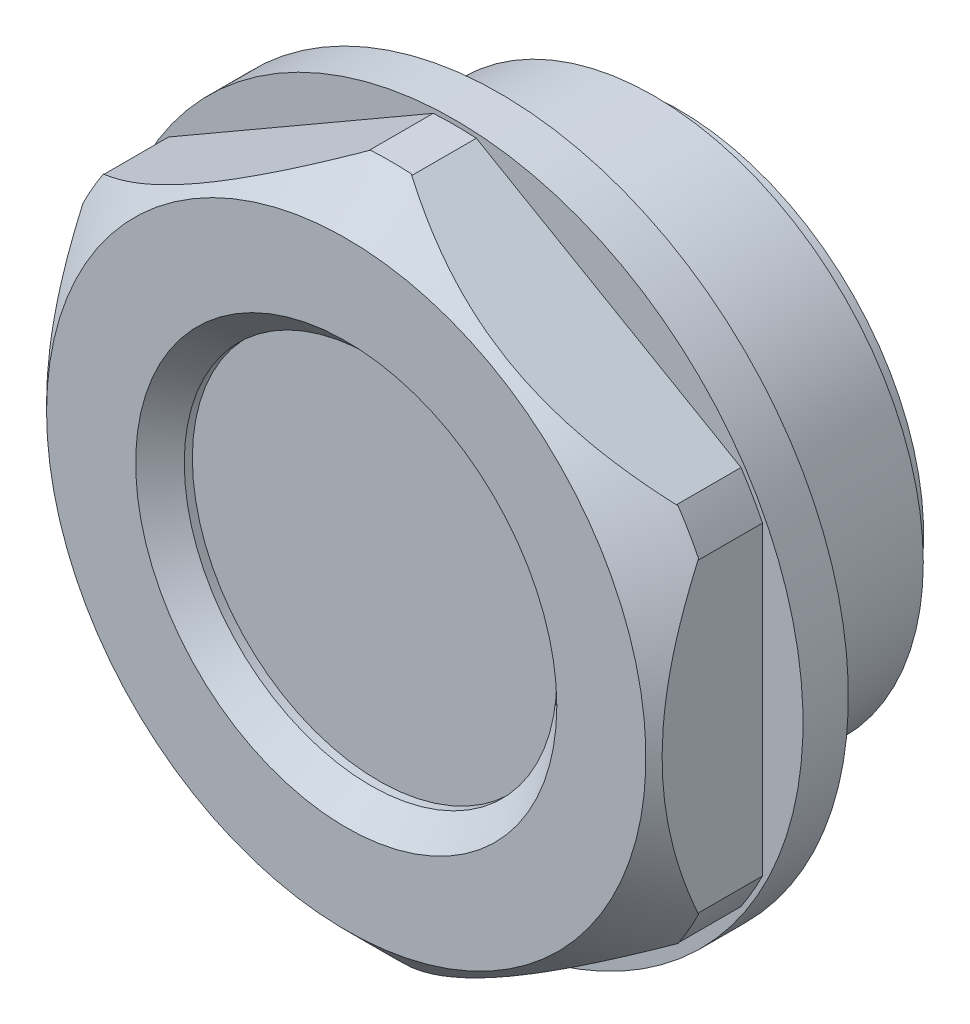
ISO-10303-21;
HEADER;
FILE_DESCRIPTION(('STEP AP214'),'2;1');
FILE_NAME('part.step','',(''),(''),'','','');
FILE_SCHEMA(('AUTOMOTIVE_DESIGN { 1 0 10303 214 1 1 1 1 }'));
ENDSEC;
DATA;
#1=APPLICATION_CONTEXT('core data for automotive mechanical design processes');
#2=APPLICATION_PROTOCOL_DEFINITION('international standard','automotive_design',2000,#1);
#3=PRODUCT_CONTEXT('',#1,'mechanical');
#4=PRODUCT('Part','Part','',(#3));
#5=PRODUCT_RELATED_PRODUCT_CATEGORY('part','',(#4));
#6=PRODUCT_DEFINITION_FORMATION('','',#4);
#7=PRODUCT_DEFINITION_CONTEXT('part definition',#1,'design');
#8=PRODUCT_DEFINITION('design','',#6,#7);
#9=PRODUCT_DEFINITION_SHAPE('','',#8);
#10=(LENGTH_UNIT() NAMED_UNIT(*) SI_UNIT(.MILLI.,.METRE.));
#11=(NAMED_UNIT(*) PLANE_ANGLE_UNIT() SI_UNIT($,.RADIAN.));
#12=(NAMED_UNIT(*) SI_UNIT($,.STERADIAN.) SOLID_ANGLE_UNIT());
#13=UNCERTAINTY_MEASURE_WITH_UNIT(LENGTH_MEASURE(1.E-05),#10,'distance_accuracy_value','');
#14=(GEOMETRIC_REPRESENTATION_CONTEXT(3) GLOBAL_UNCERTAINTY_ASSIGNED_CONTEXT((#13)) GLOBAL_UNIT_ASSIGNED_CONTEXT((#10,
#11,#12)) REPRESENTATION_CONTEXT('',''));
#15=CARTESIAN_POINT('',(0.,0.,0.));
#16=DIRECTION('',(0.,0.,1.));
#17=DIRECTION('',(1.,0.,0.));
#18=AXIS2_PLACEMENT_3D('',#15,#16,#17);
#19=CARTESIAN_POINT('',(0.,0.,0.));
#20=DIRECTION('',(0.,0.,-1.));
#21=DIRECTION('',(-1.,0.,0.));
#22=AXIS2_PLACEMENT_3D('',#19,#20,#21);
#23=CYLINDRICAL_SURFACE('',#22,21.2126992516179);
#24=CARTESIAN_POINT('',(0.,0.,4.00000000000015));
#25=DIRECTION('',(0.,0.,-1.));
#26=DIRECTION('',(-1.,0.,0.));
#27=AXIS2_PLACEMENT_3D('',#24,#25,#26);
#28=CIRCLE('',#27,21.2126992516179);
#29=CARTESIAN_POINT('',(-1.33091454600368,21.1709063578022,4.00000000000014));
#30=VERTEX_POINT('',#29);
#31=CARTESIAN_POINT('',(1.33091454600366,21.1709063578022,4.00000000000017));
#32=VERTEX_POINT('',#31);
#33=EDGE_CURVE('E157',#30,#32,#28,.T.);
#34=ORIENTED_EDGE('',*,*,#33,.F.);
#35=DIRECTION('',(0.,0.,-1.));
#36=VECTOR('',#35,1.);
#37=CARTESIAN_POINT('',(-1.33091454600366,21.1709063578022,0.));
#38=LINE('',#37,#36);
#39=CARTESIAN_POINT('',(-1.33091454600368,21.1709063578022,7.95000000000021));
#40=VERTEX_POINT('',#39);
#41=EDGE_CURVE('E339',#30,#40,#38,.F.);
#42=ORIENTED_EDGE('',*,*,#41,.T.);
#43=CARTESIAN_POINT('',(0.,0.,7.95000000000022));
#44=DIRECTION('',(0.,0.,-1.));
#45=DIRECTION('',(-1.,0.,0.));
#46=AXIS2_PLACEMENT_3D('',#43,#44,#45);
#47=CIRCLE('',#46,21.212699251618);
#48=CARTESIAN_POINT('',(1.33091454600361,21.1709063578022,7.95000000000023));
#49=VERTEX_POINT('',#48);
#50=EDGE_CURVE('E159',#40,#49,#47,.T.);
#51=ORIENTED_EDGE('',*,*,#50,.T.);
#52=DIRECTION('',(0.,0.,-1.));
#53=VECTOR('',#52,1.);
#54=CARTESIAN_POINT('',(1.33091454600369,21.1709063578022,0.));
#55=LINE('',#54,#53);
#56=EDGE_CURVE('E142',#49,#32,#55,.T.);
#57=ORIENTED_EDGE('',*,*,#56,.T.);
#58=EDGE_LOOP('',(#34,#42,#51,#57));
#59=FACE_BOUND('',#58,.T.);
#60=ADVANCED_FACE('F14',(#59),#23,.T.);
#61=CARTESIAN_POINT('',(-19.,9.43284737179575,7.9500000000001));
#62=VERTEX_POINT('',#61);
#63=CARTESIAN_POINT('',(-17.6690854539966,11.7380589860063,7.95000000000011));
#64=VERTEX_POINT('',#63);
#65=EDGE_CURVE('E174',#62,#64,#47,.T.);
#66=ORIENTED_EDGE('',*,*,#65,.T.);
#67=DIRECTION('',(0.,0.,-1.));
#68=VECTOR('',#67,1.);
#69=CARTESIAN_POINT('',(-17.6690854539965,11.7380589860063,-1.16396116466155E-13));
#70=LINE('',#69,#68);
#71=CARTESIAN_POINT('',(-17.6690854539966,11.7380589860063,4.));
#72=VERTEX_POINT('',#71);
#73=EDGE_CURVE('E337',#64,#72,#70,.T.);
#74=ORIENTED_EDGE('',*,*,#73,.T.);
#75=CARTESIAN_POINT('',(-19.,9.43284737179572,4.));
#76=VERTEX_POINT('',#75);
#77=EDGE_CURVE('E166',#76,#72,#28,.T.);
#78=ORIENTED_EDGE('',*,*,#77,.F.);
#79=DIRECTION('',(0.,0.,-1.));
#80=VECTOR('',#79,1.);
#81=CARTESIAN_POINT('',(-19.,9.43284737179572,-1.25163592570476E-13));
#82=LINE('',#81,#80);
#83=EDGE_CURVE('E331',#76,#62,#82,.F.);
#84=ORIENTED_EDGE('',*,*,#83,.T.);
#85=EDGE_LOOP('',(#66,#74,#78,#84));
#86=FACE_BOUND('',#85,.T.);
#87=ADVANCED_FACE('F239',(#86),#23,.T.);
#88=CARTESIAN_POINT('',(-17.6690854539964,-11.7380589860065,7.95000000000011));
#89=VERTEX_POINT('',#88);
#90=CARTESIAN_POINT('',(-19.,-9.43284737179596,7.9500000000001));
#91=VERTEX_POINT('',#90);
#92=EDGE_CURVE('E277',#89,#91,#47,.T.);
#93=ORIENTED_EDGE('',*,*,#92,.T.);
#94=DIRECTION('',(0.,0.,-1.));
#95=VECTOR('',#94,1.);
#96=CARTESIAN_POINT('',(-19.,-9.43284737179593,-1.25163592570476E-13));
#97=LINE('',#96,#95);
#98=CARTESIAN_POINT('',(-19.,-9.43284737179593,4.));
#99=VERTEX_POINT('',#98);
#100=EDGE_CURVE('E329',#91,#99,#97,.T.);
#101=ORIENTED_EDGE('',*,*,#100,.T.);
#102=CARTESIAN_POINT('',(-17.6690854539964,-11.7380589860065,4.));
#103=VERTEX_POINT('',#102);
#104=EDGE_CURVE('E170',#103,#99,#28,.T.);
#105=ORIENTED_EDGE('',*,*,#104,.F.);
#106=DIRECTION('',(0.,0.,-1.));
#107=VECTOR('',#106,1.);
#108=CARTESIAN_POINT('',(-17.6690854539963,-11.7380589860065,-1.16396116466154E-13));
#109=LINE('',#108,#107);
#110=EDGE_CURVE('E324',#103,#89,#109,.F.);
#111=ORIENTED_EDGE('',*,*,#110,.T.);
#112=EDGE_LOOP('',(#93,#101,#105,#111));
#113=FACE_BOUND('',#112,.T.);
#114=ADVANCED_FACE('F246',(#113),#23,.T.);
#115=CARTESIAN_POINT('',(1.33091454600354,-21.1709063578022,7.95000000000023));
#116=VERTEX_POINT('',#115);
#117=CARTESIAN_POINT('',(-1.33091454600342,-21.1709063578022,7.95000000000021));
#118=VERTEX_POINT('',#117);
#119=EDGE_CURVE('E272',#116,#118,#47,.T.);
#120=ORIENTED_EDGE('',*,*,#119,.T.);
#121=DIRECTION('',(0.,0.,-1.));
#122=VECTOR('',#121,1.);
#123=CARTESIAN_POINT('',(-1.33091454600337,-21.1709063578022,0.));
#124=LINE('',#123,#122);
#125=CARTESIAN_POINT('',(-1.33091454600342,-21.1709063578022,4.00000000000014));
#126=VERTEX_POINT('',#125);
#127=EDGE_CURVE('E322',#118,#126,#124,.T.);
#128=ORIENTED_EDGE('',*,*,#127,.T.);
#129=CARTESIAN_POINT('',(1.3309145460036,-21.1709063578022,4.00000000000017));
#130=VERTEX_POINT('',#129);
#131=EDGE_CURVE('E296',#130,#126,#28,.T.);
#132=ORIENTED_EDGE('',*,*,#131,.F.);
#133=DIRECTION('',(0.,0.,-1.));
#134=VECTOR('',#133,1.);
#135=CARTESIAN_POINT('',(1.33091454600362,-21.1709063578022,0.));
#136=LINE('',#135,#134);
#137=EDGE_CURVE('E311',#130,#116,#136,.F.);
#138=ORIENTED_EDGE('',*,*,#137,.T.);
#139=EDGE_LOOP('',(#120,#128,#132,#138));
#140=FACE_BOUND('',#139,.T.);
#141=ADVANCED_FACE('F260',(#140),#23,.T.);
#142=CARTESIAN_POINT('',(19.,-9.43284737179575,7.95000000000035));
#143=VERTEX_POINT('',#142);
#144=CARTESIAN_POINT('',(17.6690854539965,-11.7380589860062,7.95000000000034));
#145=VERTEX_POINT('',#144);
#146=EDGE_CURVE('E270',#143,#145,#47,.T.);
#147=ORIENTED_EDGE('',*,*,#146,.T.);
#148=DIRECTION('',(0.,0.,-1.));
#149=VECTOR('',#148,1.);
#150=CARTESIAN_POINT('',(17.6690854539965,-11.7380589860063,1.16396116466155E-13));
#151=LINE('',#150,#149);
#152=CARTESIAN_POINT('',(17.6690854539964,-11.7380589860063,4.00000000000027));
#153=VERTEX_POINT('',#152);
#154=EDGE_CURVE('E308',#145,#153,#151,.T.);
#155=ORIENTED_EDGE('',*,*,#154,.T.);
#156=CARTESIAN_POINT('',(19.,-9.43284737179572,4.00000000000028));
#157=VERTEX_POINT('',#156);
#158=EDGE_CURVE('E171',#157,#153,#28,.T.);
#159=ORIENTED_EDGE('',*,*,#158,.F.);
#160=DIRECTION('',(0.,0.,-1.));
#161=VECTOR('',#160,1.);
#162=CARTESIAN_POINT('',(19.,-9.43284737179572,1.25163592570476E-13));
#163=LINE('',#162,#161);
#164=EDGE_CURVE('E307',#157,#143,#163,.F.);
#165=ORIENTED_EDGE('',*,*,#164,.T.);
#166=EDGE_LOOP('',(#147,#155,#159,#165));
#167=FACE_BOUND('',#166,.T.);
#168=ADVANCED_FACE('F250',(#167),#23,.T.);
#169=CARTESIAN_POINT('',(17.6690854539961,11.7380589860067,7.95000000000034));
#170=VERTEX_POINT('',#169);
#171=CARTESIAN_POINT('',(19.,9.43284737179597,7.95000000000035));
#172=VERTEX_POINT('',#171);
#173=EDGE_CURVE('E265',#170,#172,#47,.T.);
#174=ORIENTED_EDGE('',*,*,#173,.T.);
#175=DIRECTION('',(0.,0.,-1.));
#176=VECTOR('',#175,1.);
#177=CARTESIAN_POINT('',(19.,9.43284737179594,1.25163592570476E-13));
#178=LINE('',#177,#176);
#179=CARTESIAN_POINT('',(19.,9.43284737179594,4.00000000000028));
#180=VERTEX_POINT('',#179);
#181=EDGE_CURVE('E266',#172,#180,#178,.T.);
#182=ORIENTED_EDGE('',*,*,#181,.T.);
#183=CARTESIAN_POINT('',(17.6690854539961,11.7380589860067,4.00000000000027));
#184=VERTEX_POINT('',#183);
#185=EDGE_CURVE('E167',#184,#180,#28,.T.);
#186=ORIENTED_EDGE('',*,*,#185,.F.);
#187=DIRECTION('',(0.,0.,-1.));
#188=VECTOR('',#187,1.);
#189=CARTESIAN_POINT('',(17.6690854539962,11.7380589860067,1.16396116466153E-13));
#190=LINE('',#189,#188);
#191=EDGE_CURVE('E145',#184,#170,#190,.F.);
#192=ORIENTED_EDGE('',*,*,#191,.T.);
#193=EDGE_LOOP('',(#174,#182,#186,#192));
#194=FACE_BOUND('',#193,.T.);
#195=ADVANCED_FACE('F241',(#194),#23,.T.);
#196=CARTESIAN_POINT('',(0.,-21.25,7.95000000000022));
#197=DIRECTION('',(0.,0.,-1.));
#198=DIRECTION('',(-1.,0.,0.));
#199=AXIS2_PLACEMENT_3D('',#196,#197,#198);
#200=PLANE('',#199);
#201=CARTESIAN_POINT('',(0.,0.,7.95000000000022));
#202=DIRECTION('',(0.,0.,-1.));
#203=DIRECTION('',(-1.,0.,0.));
#204=AXIS2_PLACEMENT_3D('',#201,#202,#203);
#205=CIRCLE('',#204,21.25);
#206=CARTESIAN_POINT('',(-19.,9.516433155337,7.9500000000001));
#207=VERTEX_POINT('',#206);
#208=CARTESIAN_POINT('',(-17.7414728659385,11.6962660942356,7.95000000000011));
#209=VERTEX_POINT('',#208);
#210=EDGE_CURVE('E283',#207,#209,#205,.T.);
#211=ORIENTED_EDGE('',*,*,#210,.T.);
#212=DIRECTION('',(0.866025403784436,0.5,0.));
#213=VECTOR('',#212,1.);
#214=CARTESIAN_POINT('',(-18.7015199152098,11.1419826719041,7.9500000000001));
#215=LINE('',#214,#213);
#216=EDGE_CURVE('E336',#209,#64,#215,.T.);
#217=ORIENTED_EDGE('',*,*,#216,.T.);
#218=ORIENTED_EDGE('',*,*,#65,.F.);
#219=DIRECTION('',(0.,1.,0.));
#220=VECTOR('',#219,1.);
#221=CARTESIAN_POINT('',(-19.,-21.25,7.9500000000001));
#222=LINE('',#221,#220);
#223=EDGE_CURVE('E326',#62,#207,#222,.T.);
#224=ORIENTED_EDGE('',*,*,#223,.T.);
#225=EDGE_LOOP('',(#211,#217,#218,#224));
#226=FACE_BOUND('',#225,.T.);
#227=ADVANCED_FACE('F249',(#226),#200,.T.);
#228=ORIENTED_EDGE('',*,*,#50,.F.);
#229=CARTESIAN_POINT('',(-1.25852713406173,21.2126992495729,7.95000000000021));
#230=VERTEX_POINT('',#229);
#231=EDGE_CURVE('E333',#40,#230,#215,.T.);
#232=ORIENTED_EDGE('',*,*,#231,.T.);
#233=CARTESIAN_POINT('',(1.25852713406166,21.2126992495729,7.95000000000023));
#234=VERTEX_POINT('',#233);
#235=EDGE_CURVE('E289',#230,#234,#205,.T.);
#236=ORIENTED_EDGE('',*,*,#235,.T.);
#237=DIRECTION('',(0.866025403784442,-0.5,0.));
#238=VECTOR('',#237,1.);
#239=CARTESIAN_POINT('',(18.7015199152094,11.1419826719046,7.95000000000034));
#240=LINE('',#239,#238);
#241=EDGE_CURVE('E160',#234,#49,#240,.T.);
#242=ORIENTED_EDGE('',*,*,#241,.T.);
#243=EDGE_LOOP('',(#228,#232,#236,#242));
#244=FACE_BOUND('',#243,.T.);
#245=ADVANCED_FACE('F257',(#244),#200,.T.);
#246=CARTESIAN_POINT('',(-17.7414728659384,-11.6962660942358,7.95000000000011));
#247=VERTEX_POINT('',#246);
#248=CARTESIAN_POINT('',(-19.,-9.51643315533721,7.9500000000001));
#249=VERTEX_POINT('',#248);
#250=EDGE_CURVE('E290',#247,#249,#205,.T.);
#251=ORIENTED_EDGE('',*,*,#250,.T.);
#252=EDGE_CURVE('E30',#249,#91,#222,.T.);
#253=ORIENTED_EDGE('',*,*,#252,.T.);
#254=ORIENTED_EDGE('',*,*,#92,.F.);
#255=DIRECTION('',(-0.866025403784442,0.5,0.));
#256=VECTOR('',#255,1.);
#257=CARTESIAN_POINT('',(-0.298480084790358,-21.7669826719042,7.95000000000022));
#258=LINE('',#257,#256);
#259=EDGE_CURVE('E314',#89,#247,#258,.T.);
#260=ORIENTED_EDGE('',*,*,#259,.T.);
#261=EDGE_LOOP('',(#251,#253,#254,#260));
#262=FACE_BOUND('',#261,.T.);
#263=ADVANCED_FACE('F413',(#262),#200,.T.);
#264=CARTESIAN_POINT('',(1.2585271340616,-21.2126992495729,7.95000000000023));
#265=VERTEX_POINT('',#264);
#266=CARTESIAN_POINT('',(-1.25852713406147,-21.2126992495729,7.95000000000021));
#267=VERTEX_POINT('',#266);
#268=EDGE_CURVE('E346',#265,#267,#205,.T.);
#269=ORIENTED_EDGE('',*,*,#268,.T.);
#270=EDGE_CURVE('E38',#267,#118,#258,.T.);
#271=ORIENTED_EDGE('',*,*,#270,.T.);
#272=ORIENTED_EDGE('',*,*,#119,.F.);
#273=DIRECTION('',(-0.866025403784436,-0.5,0.));
#274=VECTOR('',#273,1.);
#275=CARTESIAN_POINT('',(0.29848008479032,-21.7669826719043,7.95000000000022));
#276=LINE('',#275,#274);
#277=EDGE_CURVE('E316',#116,#265,#276,.T.);
#278=ORIENTED_EDGE('',*,*,#277,.T.);
#279=EDGE_LOOP('',(#269,#271,#272,#278));
#280=FACE_BOUND('',#279,.T.);
#281=ADVANCED_FACE('F378',(#280),#200,.T.);
#282=CARTESIAN_POINT('',(19.,-9.516433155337,7.95000000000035));
#283=VERTEX_POINT('',#282);
#284=CARTESIAN_POINT('',(17.7414728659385,-11.6962660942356,7.95000000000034));
#285=VERTEX_POINT('',#284);
#286=EDGE_CURVE('E350',#283,#285,#205,.T.);
#287=ORIENTED_EDGE('',*,*,#286,.T.);
#288=EDGE_CURVE('E312',#285,#145,#276,.T.);
#289=ORIENTED_EDGE('',*,*,#288,.T.);
#290=ORIENTED_EDGE('',*,*,#146,.F.);
#291=DIRECTION('',(0.,-1.,0.));
#292=VECTOR('',#291,1.);
#293=CARTESIAN_POINT('',(19.,-21.25,7.95000000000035));
#294=LINE('',#293,#292);
#295=EDGE_CURVE('E375',#143,#283,#294,.T.);
#296=ORIENTED_EDGE('',*,*,#295,.T.);
#297=EDGE_LOOP('',(#287,#289,#290,#296));
#298=FACE_BOUND('',#297,.T.);
#299=ADVANCED_FACE('F446',(#298),#200,.T.);
#300=CARTESIAN_POINT('',(17.7414728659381,11.6962660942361,7.95000000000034));
#301=VERTEX_POINT('',#300);
#302=CARTESIAN_POINT('',(19.,9.51643315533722,7.95000000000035));
#303=VERTEX_POINT('',#302);
#304=EDGE_CURVE('E355',#301,#303,#205,.T.);
#305=ORIENTED_EDGE('',*,*,#304,.T.);
#306=EDGE_CURVE('E377',#303,#172,#294,.T.);
#307=ORIENTED_EDGE('',*,*,#306,.T.);
#308=ORIENTED_EDGE('',*,*,#173,.F.);
#309=EDGE_CURVE('E367',#170,#301,#240,.T.);
#310=ORIENTED_EDGE('',*,*,#309,.T.);
#311=EDGE_LOOP('',(#305,#307,#308,#310));
#312=FACE_BOUND('',#311,.T.);
#313=ADVANCED_FACE('F259',(#312),#200,.T.);
#314=CARTESIAN_POINT('',(0.,0.,7.95000000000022));
#315=DIRECTION('',(0.,0.,-1.));
#316=DIRECTION('',(-1.,0.,0.));
#317=AXIS2_PLACEMENT_3D('',#314,#315,#316);
#318=CONICAL_SURFACE('',#317,21.25,0.785398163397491);
#319=CARTESIAN_POINT('',(0.,0.,10.7000000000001));
#320=DIRECTION('',(0.,0.,-1.));
#321=DIRECTION('',(-1.,0.,0.));
#322=AXIS2_PLACEMENT_3D('',#319,#320,#321);
#323=CIRCLE('',#322,18.5);
#324=CARTESIAN_POINT('',(-18.5000000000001,0.,10.7));
#325=VERTEX_POINT('',#324);
#326=EDGE_CURVE('E341',#325,#325,#323,.T.);
#327=ORIENTED_EDGE('',*,*,#326,.T.);
#328=EDGE_LOOP('',(#327));
#329=FACE_BOUND('',#328,.T.);
#330=ORIENTED_EDGE('',*,*,#235,.F.);
#331=CARTESIAN_POINT('',(-1.2581403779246,21.2129225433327,7.94980000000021));
#332=CARTESIAN_POINT('',(-1.84397380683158,20.874691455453,8.25274037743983));
#333=CARTESIAN_POINT('',(-2.43907747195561,20.5311081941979,8.53471065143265));
#334=CARTESIAN_POINT('',(-3.64878500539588,19.8326832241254,9.04497917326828));
#335=CARTESIAN_POINT('',(-4.2634555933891,19.4778029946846,9.27306486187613));
#336=CARTESIAN_POINT('',(-5.19372326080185,18.9407127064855,9.56308770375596));
#337=CARTESIAN_POINT('',(-5.50331475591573,18.7619699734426,9.6507060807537));
#338=CARTESIAN_POINT('',(-6.12595588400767,18.4024879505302,9.80783954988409));
#339=CARTESIAN_POINT('',(-6.43900559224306,18.2217486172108,9.87735424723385));
#340=CARTESIAN_POINT('',(-7.06741606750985,17.8589356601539,9.99682060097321));
#341=CARTESIAN_POINT('',(-7.38277257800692,17.6768644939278,10.0468019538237));
#342=CARTESIAN_POINT('',(-8.01542240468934,17.3116039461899,10.1262790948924));
#343=CARTESIAN_POINT('',(-8.33271566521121,17.1284145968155,10.155775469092));
#344=CARTESIAN_POINT('',(-8.94574438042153,16.7744823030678,10.192274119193));
#345=CARTESIAN_POINT('',(-9.24141564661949,16.6037764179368,10.200721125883));
#346=CARTESIAN_POINT('',(-9.83270625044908,16.2623946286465,10.199182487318));
#347=CARTESIAN_POINT('',(-10.1283255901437,16.0917187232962,10.1891979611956));
#348=CARTESIAN_POINT('',(-10.7188069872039,15.750804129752,10.1509912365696));
#349=CARTESIAN_POINT('',(-11.0136686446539,15.5805656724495,10.1227608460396));
#350=CARTESIAN_POINT('',(-11.6017516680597,15.2410357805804,10.0486065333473));
#351=CARTESIAN_POINT('',(-11.8949727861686,15.0717444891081,10.0026800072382));
#352=CARTESIAN_POINT('',(-12.4789545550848,14.7345824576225,9.89400247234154));
#353=CARTESIAN_POINT('',(-12.7697160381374,14.5667112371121,9.83125741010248));
#354=CARTESIAN_POINT('',(-13.348366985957,14.2326269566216,9.69000622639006));
#355=CARTESIAN_POINT('',(-13.6362559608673,14.0664141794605,9.61149746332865));
#356=CARTESIAN_POINT('',(-14.4950929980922,13.5705643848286,9.3540791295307));
#357=CARTESIAN_POINT('',(-15.0612287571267,13.243705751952,9.15327411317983));
#358=CARTESIAN_POINT('',(-15.7999972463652,12.8171775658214,8.85591445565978));
#359=CARTESIAN_POINT('',(-15.9794333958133,12.7135800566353,8.78087175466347));
#360=CARTESIAN_POINT('',(-16.3367380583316,12.5072901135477,8.6261138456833));
#361=CARTESIAN_POINT('',(-16.5146070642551,12.4045973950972,8.54640017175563));
#362=CARTESIAN_POINT('',(-16.8682151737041,12.2004416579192,8.38287802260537));
#363=CARTESIAN_POINT('',(-17.0439594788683,12.0989756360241,8.299084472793));
#364=CARTESIAN_POINT('',(-17.3940004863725,11.8968793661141,8.12742217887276));
#365=CARTESIAN_POINT('',(-17.5682968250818,11.7962493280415,8.03955244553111));
#366=CARTESIAN_POINT('',(-17.7418596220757,11.6960428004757,7.94980000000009));
#367=B_SPLINE_CURVE_WITH_KNOTS('',3,(#331,#332,#333,#334,#335,#336,#337,#338,#339,#340,#341,
#342,#343,#344,#345,#346,#347,#348,#349,#350,#351,#352,#353,#354,#355,#356,#357,#358,#359,#360,
#361,#362,#363,#364,#365,#366),.UNSPECIFIED.,.F.,.F.,(4,2,2,2,2,2,2,2,2,2,2,2,2,2,2,2,2,4),(0.,
2.22515927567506,4.458954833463,5.56273360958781,6.66653645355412,7.7686546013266,
8.87074122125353,9.89479990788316,10.9187964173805,11.9432530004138,12.9678603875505,
13.992105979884,15.0165233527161,17.0652965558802,17.7263822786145,18.3872520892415,
19.0458633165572,19.7046352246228),.UNSPECIFIED.);
#368=EDGE_CURVE('E9',#230,#209,#367,.T.);
#369=ORIENTED_EDGE('',*,*,#368,.T.);
#370=ORIENTED_EDGE('',*,*,#210,.F.);
#371=CARTESIAN_POINT('',(-19.,-22.4154810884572,-0.184584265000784));
#372=CARTESIAN_POINT('',(-18.9999999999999,-22.1437771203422,0.0226764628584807));
#373=CARTESIAN_POINT('',(-18.9999999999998,-21.8713174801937,0.22894578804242));
#374=CARTESIAN_POINT('',(-18.9999999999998,-21.32476107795,0.639313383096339));
#375=CARTESIAN_POINT('',(-18.9999999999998,-21.0506642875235,0.84341161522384));
#376=CARTESIAN_POINT('',(-18.9999999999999,-20.2256190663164,1.45224851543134));
#377=CARTESIAN_POINT('',(-18.9999999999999,-19.6720388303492,1.85343526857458));
#378=CARTESIAN_POINT('',(-18.9999999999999,-18.5524636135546,2.647468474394));
#379=CARTESIAN_POINT('',(-18.9999999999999,-17.9864057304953,3.04022643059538));
#380=CARTESIAN_POINT('',(-18.9999999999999,-16.8447800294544,3.81162615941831));
#381=CARTESIAN_POINT('',(-18.9999999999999,-16.2692128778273,4.19026891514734));
#382=CARTESIAN_POINT('',(-18.9999999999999,-15.0718766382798,4.95261849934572));
#383=CARTESIAN_POINT('',(-18.9999999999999,-14.4494179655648,5.33524766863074));
#384=CARTESIAN_POINT('',(-18.9999999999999,-13.1899181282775,6.07610583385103));
#385=CARTESIAN_POINT('',(-18.9999999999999,-12.5528745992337,6.43433083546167));
#386=CARTESIAN_POINT('',(-18.9999999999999,-11.2641428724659,7.11870361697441));
#387=CARTESIAN_POINT('',(-18.9999999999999,-10.6125051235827,7.44494566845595));
#388=CARTESIAN_POINT('',(-19.,-9.29109597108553,8.05804585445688));
#389=CARTESIAN_POINT('',(-19.,-8.62133313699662,8.34492222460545));
#390=CARTESIAN_POINT('',(-19.,-7.32388912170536,8.84528676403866));
#391=CARTESIAN_POINT('',(-19.,-6.69787614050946,9.06306454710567));
#392=CARTESIAN_POINT('',(-19.,-5.43018898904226,9.44846639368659));
#393=CARTESIAN_POINT('',(-19.,-4.78851378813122,9.61608714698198));
#394=CARTESIAN_POINT('',(-19.,-3.82262501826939,9.82177312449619));
#395=CARTESIAN_POINT('',(-19.,-3.50311498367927,9.88234917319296));
#396=CARTESIAN_POINT('',(-19.,-2.86160261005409,9.98831615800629));
#397=CARTESIAN_POINT('',(-19.,-2.53960062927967,10.0337092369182));
#398=CARTESIAN_POINT('',(-19.,-1.89376857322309,10.1085495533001));
#399=CARTESIAN_POINT('',(-19.,-1.56993863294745,10.1379979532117));
#400=CARTESIAN_POINT('',(-19.,-0.921197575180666,10.1804348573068));
#401=CARTESIAN_POINT('',(-19.,-0.596286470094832,10.1934235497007));
#402=CARTESIAN_POINT('',(-19.,0.0407476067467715,10.2025180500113));
#403=CARTESIAN_POINT('',(-19.,0.352861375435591,10.1992794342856));
#404=CARTESIAN_POINT('',(-19.,0.976548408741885,10.1774733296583));
#405=CARTESIAN_POINT('',(-19.,1.28812167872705,10.1589059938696));
#406=CARTESIAN_POINT('',(-19.,1.91000453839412,10.106752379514));
#407=CARTESIAN_POINT('',(-19.,2.22031412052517,10.0731660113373));
#408=CARTESIAN_POINT('',(-19.,2.83905287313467,9.99150831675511));
#409=CARTESIAN_POINT('',(-19.,3.14748179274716,9.94343509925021));
#410=CARTESIAN_POINT('',(-19.,3.76729048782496,9.83255621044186));
#411=CARTESIAN_POINT('',(-19.,4.07862634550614,9.76950562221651));
#412=CARTESIAN_POINT('',(-19.,4.69830732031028,9.63005124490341));
#413=CARTESIAN_POINT('',(-19.,5.00665206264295,9.55364580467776));
#414=CARTESIAN_POINT('',(-19.,5.92651399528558,9.30590410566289));
#415=CARTESIAN_POINT('',(-19.,6.53308639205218,9.11600047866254));
#416=CARTESIAN_POINT('',(-19.,7.77561883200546,8.6793537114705));
#417=CARTESIAN_POINT('',(-19.,8.41044992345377,8.42945294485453));
#418=CARTESIAN_POINT('',(-19.0000000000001,9.66374342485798,7.89114039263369));
#419=CARTESIAN_POINT('',(-19.0000000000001,10.2821981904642,7.60271098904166));
#420=CARTESIAN_POINT('',(-19.,11.5056678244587,6.99419434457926));
#421=CARTESIAN_POINT('',(-19.0000000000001,12.1106333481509,6.67400874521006));
#422=CARTESIAN_POINT('',(-19.0000000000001,13.3066789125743,6.00903857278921));
#423=CARTESIAN_POINT('',(-19.0000000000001,13.8977611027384,5.66425784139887));
#424=CARTESIAN_POINT('',(-19.0000000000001,15.0388896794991,4.97247995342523));
#425=CARTESIAN_POINT('',(-19.0000000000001,15.5895184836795,4.62643846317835));
#426=CARTESIAN_POINT('',(-19.0000000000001,16.68131949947,3.91970527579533));
#427=CARTESIAN_POINT('',(-19.0000000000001,17.2224909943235,3.55901247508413));
#428=CARTESIAN_POINT('',(-19.0000000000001,18.2922436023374,2.82852398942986));
#429=CARTESIAN_POINT('',(-19.0000000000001,18.8208910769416,2.4588252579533));
#430=CARTESIAN_POINT('',(-19.0000000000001,19.608480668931,1.89690942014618));
#431=CARTESIAN_POINT('',(-19.0000000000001,19.8700804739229,1.70840077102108));
#432=CARTESIAN_POINT('',(-19.0000000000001,20.3916223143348,1.32911453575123));
#433=CARTESIAN_POINT('',(-19.,20.6515643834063,1.13833699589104));
#434=CARTESIAN_POINT('',(-19.,20.9107393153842,0.946522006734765));
#435=B_SPLINE_CURVE_WITH_KNOTS('',3,(#371,#372,#373,#374,#375,#376,#377,#378,#379,#380,#381,
#382,#383,#384,#385,#386,#387,#388,#389,#390,#391,#392,#393,#394,#395,#396,#397,#398,#399,#400,
#401,#402,#403,#404,#405,#406,#407,#408,#409,#410,#411,#412,#413,#414,#415,#416,#417,#418,#419,
#420,#421,#422,#423,#424,#425,#426,#427,#428,#429,#430,#431,#432,#433,#434),.UNSPECIFIED.,.F.,
.F.,(4,2,2,2,2,2,2,2,2,2,2,2,2,2,2,2,2,2,2,2,2,2,2,2,2,2,2,2,2,2,2,4),(0.,1.02518869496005,
2.05039518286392,4.10127284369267,6.16801138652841,8.2346057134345,10.4261330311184,
12.6180181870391,14.803235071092,16.9874362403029,18.9742140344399,20.9611229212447,
21.9364251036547,22.9115895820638,23.8866829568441,24.8617651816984,25.7977799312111,
26.733785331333,27.6697963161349,28.6059295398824,29.5585758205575,30.5113399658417,
32.4161763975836,34.4614027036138,36.5075674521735,38.5602804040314,40.6126734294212,
42.5634078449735,44.5142894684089,46.4494270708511,47.4167484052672,48.3840500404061),.UNSPECIFIED.);
#436=EDGE_CURVE('E23',#207,#249,#435,.F.);
#437=ORIENTED_EDGE('',*,*,#436,.T.);
#438=ORIENTED_EDGE('',*,*,#250,.F.);
#439=CARTESIAN_POINT('',(-17.7418596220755,-11.6960428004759,7.94980000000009));
#440=CARTESIAN_POINT('',(-17.1560261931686,-12.0342738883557,8.2527403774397));
#441=CARTESIAN_POINT('',(-16.5609225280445,-12.3778571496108,8.53471065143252));
#442=CARTESIAN_POINT('',(-15.3512149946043,-13.0762821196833,9.04497917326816));
#443=CARTESIAN_POINT('',(-14.736544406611,-13.4311623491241,9.27306486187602));
#444=CARTESIAN_POINT('',(-13.8062767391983,-13.9682526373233,9.56308770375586));
#445=CARTESIAN_POINT('',(-13.4966852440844,-14.1469953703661,9.6507060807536));
#446=CARTESIAN_POINT('',(-12.8740441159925,-14.5064773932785,9.807839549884));
#447=CARTESIAN_POINT('',(-12.5609944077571,-14.6872167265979,9.87735424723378));
#448=CARTESIAN_POINT('',(-11.9325839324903,-15.0500296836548,9.99682060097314));
#449=CARTESIAN_POINT('',(-11.6172274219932,-15.232100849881,10.0468019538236));
#450=CARTESIAN_POINT('',(-10.9845775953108,-15.5973613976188,10.1262790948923));
#451=CARTESIAN_POINT('',(-10.6672843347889,-15.7805507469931,10.1557754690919));
#452=CARTESIAN_POINT('',(-10.0542556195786,-16.1344830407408,10.192274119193));
#453=CARTESIAN_POINT('',(-9.75858435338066,-16.3051889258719,10.200721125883));
#454=CARTESIAN_POINT('',(-9.1672937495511,-16.6465707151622,10.1991824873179));
#455=CARTESIAN_POINT('',(-8.87167440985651,-16.8172466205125,10.1891979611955));
#456=CARTESIAN_POINT('',(-8.28119301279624,-17.1581612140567,10.1509912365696));
#457=CARTESIAN_POINT('',(-7.98633135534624,-17.3283996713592,10.1227608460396));
#458=CARTESIAN_POINT('',(-7.39824833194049,-17.6679295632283,10.0486065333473));
#459=CARTESIAN_POINT('',(-7.10502721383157,-17.8372208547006,10.0026800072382));
#460=CARTESIAN_POINT('',(-6.52104544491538,-18.1743828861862,9.89400247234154));
#461=CARTESIAN_POINT('',(-6.23028396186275,-18.3422541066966,9.83125741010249));
#462=CARTESIAN_POINT('',(-5.65163301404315,-18.6763383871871,9.69000622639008));
#463=CARTESIAN_POINT('',(-5.36374403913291,-18.8425511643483,9.61149746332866));
#464=CARTESIAN_POINT('',(-4.50490700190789,-19.3384009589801,9.35407912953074));
#465=CARTESIAN_POINT('',(-3.93877124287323,-19.6652595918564,9.15327411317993));
#466=CARTESIAN_POINT('',(-3.20000275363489,-20.0917877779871,8.85591445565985));
#467=CARTESIAN_POINT('',(-3.02056660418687,-20.1953852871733,8.78087175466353));
#468=CARTESIAN_POINT('',(-2.6632619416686,-20.401675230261,8.62611384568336));
#469=CARTESIAN_POINT('',(-2.48539293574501,-20.5043679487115,8.54640017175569));
#470=CARTESIAN_POINT('',(-2.13178482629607,-20.7085236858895,8.38287802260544));
#471=CARTESIAN_POINT('',(-1.95604052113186,-20.8099897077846,8.29908447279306));
#472=CARTESIAN_POINT('',(-1.6059995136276,-21.0120859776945,8.12742217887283));
#473=CARTESIAN_POINT('',(-1.43170317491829,-21.1127160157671,8.03955244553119));
#474=CARTESIAN_POINT('',(-1.25814037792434,-21.2129225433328,7.94980000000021));
#475=B_SPLINE_CURVE_WITH_KNOTS('',3,(#439,#440,#441,#442,#443,#444,#445,#446,#447,#448,#449,
#450,#451,#452,#453,#454,#455,#456,#457,#458,#459,#460,#461,#462,#463,#464,#465,#466,#467,#468,
#469,#470,#471,#472,#473,#474),.UNSPECIFIED.,.F.,.F.,(4,2,2,2,2,2,2,2,2,2,2,2,2,2,2,2,2,4),(0.,
2.22515927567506,4.45895483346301,5.56273360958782,6.66653645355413,7.76865460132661,
8.87074122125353,9.89479990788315,10.9187964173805,11.9432530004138,12.9678603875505,
13.992105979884,15.016523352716,17.0652965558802,17.7263822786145,18.3872520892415,
19.0458633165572,19.7046352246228),.UNSPECIFIED.);
#476=EDGE_CURVE('E381',#247,#267,#475,.T.);
#477=ORIENTED_EDGE('',*,*,#476,.T.);
#478=ORIENTED_EDGE('',*,*,#268,.F.);
#479=CARTESIAN_POINT('',(1.25814037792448,-21.2129225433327,7.94980000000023));
#480=CARTESIAN_POINT('',(1.84397380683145,-20.874691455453,8.25274037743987));
#481=CARTESIAN_POINT('',(2.43907747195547,-20.5311081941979,8.53471065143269));
#482=CARTESIAN_POINT('',(3.64878500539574,-19.8326832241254,9.04497917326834));
#483=CARTESIAN_POINT('',(4.26345559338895,-19.4778029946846,9.2730648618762));
#484=CARTESIAN_POINT('',(5.19372326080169,-18.9407127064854,9.56308770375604));
#485=CARTESIAN_POINT('',(5.50331475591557,-18.7619699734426,9.65070608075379));
#486=CARTESIAN_POINT('',(6.12595588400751,-18.4024879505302,9.80783954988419));
#487=CARTESIAN_POINT('',(6.4390055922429,-18.2217486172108,9.87735424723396));
#488=CARTESIAN_POINT('',(7.06741606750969,-17.8589356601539,9.99682060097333));
#489=CARTESIAN_POINT('',(7.38277257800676,-17.6768644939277,10.0468019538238));
#490=CARTESIAN_POINT('',(8.01542240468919,-17.3116039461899,10.1262790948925));
#491=CARTESIAN_POINT('',(8.33271566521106,-17.1284145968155,10.1557754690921));
#492=CARTESIAN_POINT('',(8.94574438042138,-16.7744823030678,10.1922741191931));
#493=CARTESIAN_POINT('',(9.24141564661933,-16.6037764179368,10.2007211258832));
#494=CARTESIAN_POINT('',(9.83270625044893,-16.2623946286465,10.1991824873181));
#495=CARTESIAN_POINT('',(10.1283255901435,-16.0917187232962,10.1891979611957));
#496=CARTESIAN_POINT('',(10.7188069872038,-15.750804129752,10.1509912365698));
#497=CARTESIAN_POINT('',(11.0136686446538,-15.5805656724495,10.1227608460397));
#498=CARTESIAN_POINT('',(11.6017516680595,-15.2410357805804,10.0486065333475));
#499=CARTESIAN_POINT('',(11.8949727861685,-15.0717444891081,10.0026800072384));
#500=CARTESIAN_POINT('',(12.4789545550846,-14.7345824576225,9.89400247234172));
#501=CARTESIAN_POINT('',(12.7697160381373,-14.5667112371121,9.83125741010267));
#502=CARTESIAN_POINT('',(13.3483669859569,-14.2326269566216,9.69000622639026));
#503=CARTESIAN_POINT('',(13.6362559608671,-14.0664141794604,9.61149746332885));
#504=CARTESIAN_POINT('',(14.4950929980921,-13.5705643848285,9.3540791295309));
#505=CARTESIAN_POINT('',(15.0612287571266,-13.243705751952,9.15327411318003));
#506=CARTESIAN_POINT('',(15.7999972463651,-12.8171775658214,8.85591445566));
#507=CARTESIAN_POINT('',(15.9794333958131,-12.7135800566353,8.78087175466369));
#508=CARTESIAN_POINT('',(16.3367380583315,-12.5072901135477,8.62611384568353));
#509=CARTESIAN_POINT('',(16.514607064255,-12.4045973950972,8.54640017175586));
#510=CARTESIAN_POINT('',(16.868215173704,-12.2004416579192,8.38287802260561));
#511=CARTESIAN_POINT('',(17.0439594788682,-12.0989756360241,8.29908447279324));
#512=CARTESIAN_POINT('',(17.3940004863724,-11.8968793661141,8.127422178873));
#513=CARTESIAN_POINT('',(17.5682968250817,-11.7962493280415,8.03955244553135));
#514=CARTESIAN_POINT('',(17.7418596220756,-11.6960428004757,7.94980000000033));
#515=B_SPLINE_CURVE_WITH_KNOTS('',3,(#479,#480,#481,#482,#483,#484,#485,#486,#487,#488,#489,
#490,#491,#492,#493,#494,#495,#496,#497,#498,#499,#500,#501,#502,#503,#504,#505,#506,#507,#508,
#509,#510,#511,#512,#513,#514),.UNSPECIFIED.,.F.,.F.,(4,2,2,2,2,2,2,2,2,2,2,2,2,2,2,2,2,4),(0.,
2.22515927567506,4.458954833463,5.56273360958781,6.66653645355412,7.76865460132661,
8.87074122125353,9.89479990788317,10.9187964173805,11.9432530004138,12.9678603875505,
13.992105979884,15.0165233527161,17.0652965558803,17.7263822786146,18.3872520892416,
19.0458633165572,19.7046352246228),.UNSPECIFIED.);
#516=EDGE_CURVE('E380',#265,#285,#515,.T.);
#517=ORIENTED_EDGE('',*,*,#516,.T.);
#518=ORIENTED_EDGE('',*,*,#286,.F.);
#519=CARTESIAN_POINT('',(19.,-22.415481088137,-0.184584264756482));
#520=CARTESIAN_POINT('',(19.,-22.1437771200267,0.0226764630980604));
#521=CARTESIAN_POINT('',(19.,-21.8713174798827,0.228945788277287));
#522=CARTESIAN_POINT('',(19.0000000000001,-21.3247610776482,0.639313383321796));
#523=CARTESIAN_POINT('',(19.,-21.0506642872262,0.843411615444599));
#524=CARTESIAN_POINT('',(19.,-20.225619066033,1.45224851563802));
#525=CARTESIAN_POINT('',(19.,-19.6720388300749,1.85343526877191));
#526=CARTESIAN_POINT('',(19.,-18.5524636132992,2.64746847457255));
#527=CARTESIAN_POINT('',(19.,-17.9864057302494,3.0402264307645));
#528=CARTESIAN_POINT('',(19.,-16.8447800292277,3.81162615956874));
#529=CARTESIAN_POINT('',(19.,-16.2692128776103,4.19026891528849));
#530=CARTESIAN_POINT('',(19.,-15.0718766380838,4.95261849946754));
#531=CARTESIAN_POINT('',(19.,-14.4494179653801,5.33524766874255));
#532=CARTESIAN_POINT('',(19.,-13.1899181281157,6.07610583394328));
#533=CARTESIAN_POINT('',(19.,-12.5528745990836,6.43433083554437));
#534=CARTESIAN_POINT('',(18.9999999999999,-11.2641428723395,7.11870361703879));
#535=CARTESIAN_POINT('',(18.9999999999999,-10.6125051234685,7.44494566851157));
#536=CARTESIAN_POINT('',(19.,-9.29109597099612,8.05804585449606));
#537=CARTESIAN_POINT('',(19.,-8.62133313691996,8.34492222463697));
#538=CARTESIAN_POINT('',(19.,-7.32388912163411,8.8452867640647));
#539=CARTESIAN_POINT('',(18.9999999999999,-6.69787614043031,9.06306454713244));
#540=CARTESIAN_POINT('',(18.9999999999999,-5.43018898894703,9.44846639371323));
#541=CARTESIAN_POINT('',(18.9999999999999,-4.7885137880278,9.61608714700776));
#542=CARTESIAN_POINT('',(18.9999999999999,-3.82262501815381,9.82177312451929));
#543=CARTESIAN_POINT('',(18.9999999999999,-3.50311498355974,9.88234917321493));
#544=CARTESIAN_POINT('',(18.9999999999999,-2.86160260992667,9.98831615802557));
#545=CARTESIAN_POINT('',(18.9999999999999,-2.53960062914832,10.0337092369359));
#546=CARTESIAN_POINT('',(18.9999999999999,-1.89376857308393,10.1085495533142));
#547=CARTESIAN_POINT('',(18.9999999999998,-1.56993863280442,10.1379979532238));
#548=CARTESIAN_POINT('',(18.9999999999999,-0.921197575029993,10.1804348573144));
#549=CARTESIAN_POINT('',(19.,-0.596286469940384,10.1934235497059));
#550=CARTESIAN_POINT('',(19.,0.0407476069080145,10.2025180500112));
#551=CARTESIAN_POINT('',(18.9999999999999,0.35286137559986,10.1992794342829));
#552=CARTESIAN_POINT('',(18.9999999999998,0.97654840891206,10.1774733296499));
#553=CARTESIAN_POINT('',(18.9999999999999,1.2881216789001,10.1589059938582));
#554=CARTESIAN_POINT('',(18.9999999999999,1.91000453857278,10.1067523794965));
#555=CARTESIAN_POINT('',(18.9999999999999,2.22031412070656,10.0731660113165));
#556=CARTESIAN_POINT('',(18.9999999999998,2.83905287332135,9.99150831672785));
#557=CARTESIAN_POINT('',(18.9999999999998,3.14748179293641,9.9434350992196));
#558=CARTESIAN_POINT('',(18.9999999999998,3.76729048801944,9.83255621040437));
#559=CARTESIAN_POINT('',(18.9999999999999,4.07862634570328,9.76950562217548));
#560=CARTESIAN_POINT('',(18.9999999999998,4.69830732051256,9.63005124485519));
#561=CARTESIAN_POINT('',(18.9999999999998,5.00665206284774,9.55364580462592));
#562=CARTESIAN_POINT('',(18.9999999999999,5.92651399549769,9.30590410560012));
#563=CARTESIAN_POINT('',(19.,6.5330863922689,9.11600047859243));
#564=CARTESIAN_POINT('',(19.,7.77561883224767,8.67935371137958));
#565=CARTESIAN_POINT('',(18.9999999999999,8.41044992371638,8.42945294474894));
#566=CARTESIAN_POINT('',(18.9999999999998,9.66374342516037,7.8911403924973));
#567=CARTESIAN_POINT('',(18.9999999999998,10.2821981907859,7.60271098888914));
#568=CARTESIAN_POINT('',(18.9999999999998,11.5056678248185,6.9941943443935));
#569=CARTESIAN_POINT('',(18.9999999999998,12.1106333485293,6.67400874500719));
#570=CARTESIAN_POINT('',(18.9999999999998,13.3066789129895,6.00903857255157));
#571=CARTESIAN_POINT('',(18.9999999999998,13.8977611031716,5.66425784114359));
#572=CARTESIAN_POINT('',(18.9999999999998,15.0388896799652,4.97247995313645));
#573=CARTESIAN_POINT('',(18.9999999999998,15.5895184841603,4.62643846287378));
#574=CARTESIAN_POINT('',(18.9999999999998,16.6813194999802,3.91970527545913));
#575=CARTESIAN_POINT('',(18.9999999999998,17.2224909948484,3.55901247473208));
#576=CARTESIAN_POINT('',(18.9999999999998,18.2922436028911,2.82852398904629));
#577=CARTESIAN_POINT('',(18.9999999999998,18.8208910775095,2.45882525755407));
#578=CARTESIAN_POINT('',(18.9999999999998,19.6084806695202,1.89690941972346));
#579=CARTESIAN_POINT('',(18.9999999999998,19.8700804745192,1.70840077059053));
#580=CARTESIAN_POINT('',(18.9999999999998,20.3916223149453,1.32911453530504));
#581=CARTESIAN_POINT('',(18.9999999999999,20.6515643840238,1.13833699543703));
#582=CARTESIAN_POINT('',(19.,20.9107393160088,0.946522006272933));
#583=B_SPLINE_CURVE_WITH_KNOTS('',3,(#519,#520,#521,#522,#523,#524,#525,#526,#527,#528,#529,
#530,#531,#532,#533,#534,#535,#536,#537,#538,#539,#540,#541,#542,#543,#544,#545,#546,#547,#548,
#549,#550,#551,#552,#553,#554,#555,#556,#557,#558,#559,#560,#561,#562,#563,#564,#565,#566,#567,
#568,#569,#570,#571,#572,#573,#574,#575,#576,#577,#578,#579,#580,#581,#582),.UNSPECIFIED.,.F.,
.F.,(4,2,2,2,2,2,2,2,2,2,2,2,2,2,2,2,2,2,2,2,2,2,2,2,2,2,2,2,2,2,2,4),(0.,1.02518869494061,
2.05039518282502,4.10127284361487,6.16801138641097,8.23460571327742,10.4261330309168,
12.6180181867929,14.8032350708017,16.9874362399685,18.9742140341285,20.9611229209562,
21.9364251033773,22.9115895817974,23.8866829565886,24.861765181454,25.7977799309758,
26.7337853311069,27.6697963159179,28.6059295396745,29.5585758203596,30.5113399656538,
32.4161763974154,34.4614027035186,36.5075674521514,38.5602804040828,40.612673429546,
42.5634078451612,44.5142894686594,46.4494270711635,47.4167484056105,48.3840500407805),.UNSPECIFIED.);
#584=EDGE_CURVE('E208',#283,#303,#583,.T.);
#585=ORIENTED_EDGE('',*,*,#584,.T.);
#586=ORIENTED_EDGE('',*,*,#304,.F.);
#587=CARTESIAN_POINT('',(17.7418596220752,11.6960428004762,7.94980000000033));
#588=CARTESIAN_POINT('',(17.1560261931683,12.034273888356,8.25274037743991));
#589=CARTESIAN_POINT('',(16.5609225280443,12.3778571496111,8.5347106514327));
#590=CARTESIAN_POINT('',(15.351214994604,13.0762821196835,9.0449791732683));
#591=CARTESIAN_POINT('',(14.7365444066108,13.4311623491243,9.27306486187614));
#592=CARTESIAN_POINT('',(13.8062767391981,13.9682526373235,9.56308770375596));
#593=CARTESIAN_POINT('',(13.4966852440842,14.1469953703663,9.65070608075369));
#594=CARTESIAN_POINT('',(12.8740441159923,14.5064773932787,9.80783954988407));
#595=CARTESIAN_POINT('',(12.5609944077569,14.6872167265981,9.87735424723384));
#596=CARTESIAN_POINT('',(11.9325839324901,15.050029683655,9.99682060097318));
#597=CARTESIAN_POINT('',(11.6172274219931,15.2321008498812,10.0468019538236));
#598=CARTESIAN_POINT('',(10.9845775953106,15.597361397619,10.1262790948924));
#599=CARTESIAN_POINT('',(10.6672843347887,15.7805507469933,10.155775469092));
#600=CARTESIAN_POINT('',(10.0542556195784,16.1344830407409,10.192274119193));
#601=CARTESIAN_POINT('',(9.75858435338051,16.305188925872,10.200721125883));
#602=CARTESIAN_POINT('',(9.16729374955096,16.6465707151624,10.1991824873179));
#603=CARTESIAN_POINT('',(8.87167440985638,16.8172466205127,10.1891979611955));
#604=CARTESIAN_POINT('',(8.28119301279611,17.1581612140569,10.1509912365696));
#605=CARTESIAN_POINT('',(7.98633135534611,17.3283996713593,10.1227608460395));
#606=CARTESIAN_POINT('',(7.39824833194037,17.6679295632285,10.0486065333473));
#607=CARTESIAN_POINT('',(7.10502721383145,17.8372208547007,10.0026800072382));
#608=CARTESIAN_POINT('',(6.52104544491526,18.1743828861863,9.89400247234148));
#609=CARTESIAN_POINT('',(6.23028396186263,18.3422541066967,9.83125741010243));
#610=CARTESIAN_POINT('',(5.65163301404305,18.6763383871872,9.69000622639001));
#611=CARTESIAN_POINT('',(5.36374403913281,18.8425511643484,9.61149746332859));
#612=CARTESIAN_POINT('',(4.5049070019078,19.3384009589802,9.35407912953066));
#613=CARTESIAN_POINT('',(3.93877124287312,19.6652595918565,9.15327411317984));
#614=CARTESIAN_POINT('',(3.20000275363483,20.0917877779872,8.85591445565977));
#615=CARTESIAN_POINT('',(3.02056660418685,20.1953852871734,8.78087175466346));
#616=CARTESIAN_POINT('',(2.66326194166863,20.4016752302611,8.6261138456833));
#617=CARTESIAN_POINT('',(2.48539293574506,20.5043679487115,8.54640017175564));
#618=CARTESIAN_POINT('',(2.13178482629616,20.7085236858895,8.38287802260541));
#619=CARTESIAN_POINT('',(1.95604052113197,20.8099897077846,8.29908447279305));
#620=CARTESIAN_POINT('',(1.60599951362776,21.0120859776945,8.12742217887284));
#621=CARTESIAN_POINT('',(1.43170317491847,21.1127160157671,8.03955244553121));
#622=CARTESIAN_POINT('',(1.25814037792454,21.2129225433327,7.94980000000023));
#623=B_SPLINE_CURVE_WITH_KNOTS('',3,(#587,#588,#589,#590,#591,#592,#593,#594,#595,#596,#597,
#598,#599,#600,#601,#602,#603,#604,#605,#606,#607,#608,#609,#610,#611,#612,#613,#614,#615,#616,
#617,#618,#619,#620,#621,#622),.UNSPECIFIED.,.F.,.F.,(4,2,2,2,2,2,2,2,2,2,2,2,2,2,2,2,2,4),(0.,
2.225159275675,4.45895483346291,5.5627336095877,6.66653645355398,7.76865460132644,
8.87074122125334,9.89479990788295,10.9187964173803,11.9432530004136,12.9678603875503,
13.9921059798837,15.0165233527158,17.0652965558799,17.7263822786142,18.3872520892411,
19.0458633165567,19.7046352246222),.UNSPECIFIED.);
#624=EDGE_CURVE('E199',#301,#234,#623,.T.);
#625=ORIENTED_EDGE('',*,*,#624,.T.);
#626=EDGE_LOOP('',(#330,#369,#370,#437,#438,#477,#478,#517,#518,#585,#586,#625));
#627=FACE_BOUND('',#626,.T.);
#628=ADVANCED_FACE('F215',(#329,#627),#318,.T.);
#629=CARTESIAN_POINT('',(0.,-15.1455,-9.8));
#630=DIRECTION('',(0.,0.,-1.));
#631=DIRECTION('',(-1.,0.,0.));
#632=AXIS2_PLACEMENT_3D('',#629,#630,#631);
#633=PLANE('',#632);
#634=CARTESIAN_POINT('',(0.,0.,-9.8));
#635=DIRECTION('',(0.,0.,-1.));
#636=DIRECTION('',(-1.,0.,0.));
#637=AXIS2_PLACEMENT_3D('',#634,#635,#636);
#638=CIRCLE('',#637,15.1455);
#639=CARTESIAN_POINT('',(-15.1454999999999,0.,-9.8000000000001));
#640=VERTEX_POINT('',#639);
#641=EDGE_CURVE('E196',#640,#640,#638,.T.);
#642=ORIENTED_EDGE('',*,*,#641,.T.);
#643=EDGE_LOOP('',(#642));
#644=FACE_BOUND('',#643,.T.);
#645=ADVANCED_FACE('F16',(#644),#633,.T.);
#646=CARTESIAN_POINT('',(0.,0.,0.));
#647=DIRECTION('',(0.,0.,-1.));
#648=DIRECTION('',(-1.,0.,0.));
#649=AXIS2_PLACEMENT_3D('',#646,#647,#648);
#650=CYLINDRICAL_SURFACE('',#649,15.1455);
#651=CARTESIAN_POINT('',(0.,0.,-8.29999999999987));
#652=DIRECTION('',(0.,0.,-1.));
#653=DIRECTION('',(-1.,0.,0.));
#654=AXIS2_PLACEMENT_3D('',#651,#652,#653);
#655=CIRCLE('',#654,15.1455);
#656=CARTESIAN_POINT('',(-15.1454999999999,0.,-8.29999999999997));
#657=VERTEX_POINT('',#656);
#658=EDGE_CURVE('E193',#657,#657,#655,.T.);
#659=ORIENTED_EDGE('',*,*,#658,.T.);
#660=EDGE_LOOP('',(#659));
#661=FACE_BOUND('',#660,.T.);
#662=ORIENTED_EDGE('',*,*,#641,.F.);
#663=EDGE_LOOP('',(#662));
#664=FACE_BOUND('',#663,.T.);
#665=ADVANCED_FACE('F554',(#661,#664),#650,.T.);
#666=CARTESIAN_POINT('',(0.,-16.6245,-8.29999999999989));
#667=DIRECTION('',(0.,0.,-1.));
#668=DIRECTION('',(-1.,0.,0.));
#669=AXIS2_PLACEMENT_3D('',#666,#667,#668);
#670=PLANE('',#669);
#671=CARTESIAN_POINT('',(0.,0.,-8.29999999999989));
#672=DIRECTION('',(0.,0.,-1.));
#673=DIRECTION('',(-1.,0.,0.));
#674=AXIS2_PLACEMENT_3D('',#671,#672,#673);
#675=CIRCLE('',#674,16.6245);
#676=CARTESIAN_POINT('',(-16.6244999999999,0.,-8.3));
#677=VERTEX_POINT('',#676);
#678=EDGE_CURVE('E190',#677,#677,#675,.T.);
#679=ORIENTED_EDGE('',*,*,#678,.T.);
#680=EDGE_LOOP('',(#679));
#681=FACE_BOUND('',#680,.T.);
#682=ORIENTED_EDGE('',*,*,#658,.F.);
#683=EDGE_LOOP('',(#682));
#684=FACE_BOUND('',#683,.T.);
#685=ADVANCED_FACE('F562',(#681,#684),#670,.T.);
#686=CARTESIAN_POINT('',(0.,0.,0.));
#687=DIRECTION('',(0.,0.,-1.));
#688=DIRECTION('',(-1.,0.,0.));
#689=AXIS2_PLACEMENT_3D('',#686,#687,#688);
#690=CYLINDRICAL_SURFACE('',#689,16.6245);
#691=CARTESIAN_POINT('',(0.,0.,1.16088330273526E-13));
#692=DIRECTION('',(0.,0.,-1.));
#693=DIRECTION('',(-1.,0.,0.));
#694=AXIS2_PLACEMENT_3D('',#691,#692,#693);
#695=CIRCLE('',#694,16.6245);
#696=CARTESIAN_POINT('',(-16.6245,0.,0.));
#697=VERTEX_POINT('',#696);
#698=EDGE_CURVE('E187',#697,#697,#695,.T.);
#699=ORIENTED_EDGE('',*,*,#698,.T.);
#700=EDGE_LOOP('',(#699));
#701=FACE_BOUND('',#700,.T.);
#702=ORIENTED_EDGE('',*,*,#678,.F.);
#703=EDGE_LOOP('',(#702));
#704=FACE_BOUND('',#703,.T.);
#705=ADVANCED_FACE('F570',(#701,#704),#690,.T.);
#706=CARTESIAN_POINT('',(0.,-16.6245,1.16088330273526E-13));
#707=DIRECTION('',(0.,0.,-1.));
#708=DIRECTION('',(-1.,0.,0.));
#709=AXIS2_PLACEMENT_3D('',#706,#707,#708);
#710=PLANE('',#709);
#711=CARTESIAN_POINT('',(0.,0.,1.32676367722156E-13));
#712=DIRECTION('',(0.,0.,-1.));
#713=DIRECTION('',(-1.,0.,0.));
#714=AXIS2_PLACEMENT_3D('',#711,#712,#713);
#715=CIRCLE('',#714,19.);
#716=CARTESIAN_POINT('',(-19.,0.,0.));
#717=VERTEX_POINT('',#716);
#718=EDGE_CURVE('E184',#717,#717,#715,.T.);
#719=ORIENTED_EDGE('',*,*,#718,.T.);
#720=EDGE_LOOP('',(#719));
#721=FACE_BOUND('',#720,.T.);
#722=ORIENTED_EDGE('',*,*,#698,.F.);
#723=EDGE_LOOP('',(#722));
#724=FACE_BOUND('',#723,.T.);
#725=ADVANCED_FACE('F579',(#721,#724),#710,.T.);
#726=CARTESIAN_POINT('',(0.,0.,0.));
#727=DIRECTION('',(0.,0.,-1.));
#728=DIRECTION('',(-1.,0.,0.));
#729=AXIS2_PLACEMENT_3D('',#726,#727,#728);
#730=CYLINDRICAL_SURFACE('',#729,19.);
#731=CARTESIAN_POINT('',(0.,0.,1.20000000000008));
#732=DIRECTION('',(0.,0.,-1.));
#733=DIRECTION('',(-1.,0.,0.));
#734=AXIS2_PLACEMENT_3D('',#731,#732,#733);
#735=CIRCLE('',#734,19.);
#736=CARTESIAN_POINT('',(-19.,0.,1.19999999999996));
#737=VERTEX_POINT('',#736);
#738=EDGE_CURVE('E181',#737,#737,#735,.T.);
#739=ORIENTED_EDGE('',*,*,#738,.T.);
#740=EDGE_LOOP('',(#739));
#741=FACE_BOUND('',#740,.T.);
#742=ORIENTED_EDGE('',*,*,#718,.F.);
#743=EDGE_LOOP('',(#742));
#744=FACE_BOUND('',#743,.T.);
#745=ADVANCED_FACE('F588',(#741,#744),#730,.T.);
#746=CARTESIAN_POINT('',(0.,-21.5,1.20000000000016));
#747=DIRECTION('',(0.,0.,-1.));
#748=DIRECTION('',(-1.,0.,0.));
#749=AXIS2_PLACEMENT_3D('',#746,#747,#748);
#750=PLANE('',#749);
#751=CARTESIAN_POINT('',(0.,0.,1.20000000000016));
#752=DIRECTION('',(0.,0.,-1.));
#753=DIRECTION('',(-1.,0.,0.));
#754=AXIS2_PLACEMENT_3D('',#751,#752,#753);
#755=CIRCLE('',#754,21.5);
#756=CARTESIAN_POINT('',(-21.5,0.,1.20000000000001));
#757=VERTEX_POINT('',#756);
#758=EDGE_CURVE('E178',#757,#757,#755,.T.);
#759=ORIENTED_EDGE('',*,*,#758,.T.);
#760=EDGE_LOOP('',(#759));
#761=FACE_BOUND('',#760,.T.);
#762=ORIENTED_EDGE('',*,*,#738,.F.);
#763=EDGE_LOOP('',(#762));
#764=FACE_BOUND('',#763,.T.);
#765=ADVANCED_FACE('F597',(#761,#764),#750,.T.);
#766=CARTESIAN_POINT('',(0.,0.,0.));
#767=DIRECTION('',(0.,0.,-1.));
#768=DIRECTION('',(-1.,0.,0.));
#769=AXIS2_PLACEMENT_3D('',#766,#767,#768);
#770=CYLINDRICAL_SURFACE('',#769,21.5);
#771=CARTESIAN_POINT('',(0.,0.,4.00000000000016));
#772=DIRECTION('',(0.,0.,-1.));
#773=DIRECTION('',(-1.,0.,0.));
#774=AXIS2_PLACEMENT_3D('',#771,#772,#773);
#775=CIRCLE('',#774,21.5);
#776=CARTESIAN_POINT('',(-21.5,0.,4.00000000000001));
#777=VERTEX_POINT('',#776);
#778=EDGE_CURVE('E169',#777,#777,#775,.T.);
#779=ORIENTED_EDGE('',*,*,#778,.T.);
#780=EDGE_LOOP('',(#779));
#781=FACE_BOUND('',#780,.T.);
#782=ORIENTED_EDGE('',*,*,#758,.F.);
#783=EDGE_LOOP('',(#782));
#784=FACE_BOUND('',#783,.T.);
#785=ADVANCED_FACE('F234',(#781,#784),#770,.T.);
#786=CARTESIAN_POINT('',(0.,-21.5,4.00000000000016));
#787=DIRECTION('',(0.,0.,1.));
#788=DIRECTION('',(1.,0.,0.));
#789=AXIS2_PLACEMENT_3D('',#786,#787,#788);
#790=PLANE('',#789);
#791=DIRECTION('',(0.866025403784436,0.5,0.));
#792=VECTOR('',#791,1.);
#793=CARTESIAN_POINT('',(0.,21.9393102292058,4.00000000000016));
#794=LINE('',#793,#792);
#795=EDGE_CURVE('E151',#72,#30,#794,.T.);
#796=ORIENTED_EDGE('',*,*,#795,.T.);
#797=ORIENTED_EDGE('',*,*,#33,.T.);
#798=DIRECTION('',(0.866025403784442,-0.5,0.));
#799=VECTOR('',#798,1.);
#800=CARTESIAN_POINT('',(19.,10.9696551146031,4.00000000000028));
#801=LINE('',#800,#799);
#802=EDGE_CURVE('E139',#32,#184,#801,.T.);
#803=ORIENTED_EDGE('',*,*,#802,.T.);
#804=ORIENTED_EDGE('',*,*,#185,.T.);
#805=DIRECTION('',(0.,-1.,0.));
#806=VECTOR('',#805,1.);
#807=CARTESIAN_POINT('',(19.,-10.9696551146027,4.00000000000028));
#808=LINE('',#807,#806);
#809=EDGE_CURVE('E150',#180,#157,#808,.T.);
#810=ORIENTED_EDGE('',*,*,#809,.T.);
#811=ORIENTED_EDGE('',*,*,#158,.T.);
#812=DIRECTION('',(-0.866025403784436,-0.5,0.));
#813=VECTOR('',#812,1.);
#814=CARTESIAN_POINT('',(1.00826684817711E-13,-21.9393102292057,4.00000000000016));
#815=LINE('',#814,#813);
#816=EDGE_CURVE('E306',#153,#130,#815,.T.);
#817=ORIENTED_EDGE('',*,*,#816,.T.);
#818=ORIENTED_EDGE('',*,*,#131,.T.);
#819=DIRECTION('',(-0.866025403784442,0.5,0.));
#820=VECTOR('',#819,1.);
#821=CARTESIAN_POINT('',(-19.,-10.969655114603,4.));
#822=LINE('',#821,#820);
#823=EDGE_CURVE('E370',#126,#103,#822,.T.);
#824=ORIENTED_EDGE('',*,*,#823,.T.);
#825=ORIENTED_EDGE('',*,*,#104,.T.);
#826=DIRECTION('',(0.,1.,0.));
#827=VECTOR('',#826,1.);
#828=CARTESIAN_POINT('',(-19.,10.9696551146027,4.));
#829=LINE('',#828,#827);
#830=EDGE_CURVE('E368',#99,#76,#829,.T.);
#831=ORIENTED_EDGE('',*,*,#830,.T.);
#832=ORIENTED_EDGE('',*,*,#77,.T.);
#833=EDGE_LOOP('',(#796,#797,#803,#804,#810,#811,#817,#818,#824,#825,#831,#832));
#834=FACE_BOUND('',#833,.T.);
#835=ORIENTED_EDGE('',*,*,#778,.F.);
#836=EDGE_LOOP('',(#835));
#837=FACE_BOUND('',#836,.T.);
#838=ADVANCED_FACE('F163',(#834,#837),#790,.T.);
#839=CARTESIAN_POINT('',(0.,-18.5,10.7000000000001));
#840=DIRECTION('',(0.,0.,1.));
#841=DIRECTION('',(1.,0.,0.));
#842=AXIS2_PLACEMENT_3D('',#839,#840,#841);
#843=PLANE('',#842);
#844=CARTESIAN_POINT('',(0.,0.,10.7000000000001));
#845=DIRECTION('',(0.,0.,1.));
#846=DIRECTION('',(1.,0.,0.));
#847=AXIS2_PLACEMENT_3D('',#844,#845,#846);
#848=CIRCLE('',#847,13.);
#849=CARTESIAN_POINT('',(13.0000000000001,0.,10.7000000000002));
#850=VERTEX_POINT('',#849);
#851=EDGE_CURVE('E18',#850,#850,#848,.T.);
#852=ORIENTED_EDGE('',*,*,#851,.F.);
#853=EDGE_LOOP('',(#852));
#854=FACE_BOUND('',#853,.T.);
#855=ORIENTED_EDGE('',*,*,#326,.F.);
#856=EDGE_LOOP('',(#855));
#857=FACE_BOUND('',#856,.T.);
#858=ADVANCED_FACE('F223',(#854,#857),#843,.T.);
#859=CARTESIAN_POINT('',(19.0000000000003,10.9696551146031,-54.0459588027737));
#860=DIRECTION('',(0.5,0.866025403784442,0.));
#861=DIRECTION('',(-0.866025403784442,0.5,0.));
#862=AXIS2_PLACEMENT_3D('',#859,#860,#861);
#863=PLANE('',#862);
#864=ORIENTED_EDGE('',*,*,#802,.F.);
#865=ORIENTED_EDGE('',*,*,#56,.F.);
#866=ORIENTED_EDGE('',*,*,#241,.F.);
#867=ORIENTED_EDGE('',*,*,#624,.F.);
#868=ORIENTED_EDGE('',*,*,#309,.F.);
#869=ORIENTED_EDGE('',*,*,#191,.F.);
#870=EDGE_LOOP('',(#864,#865,#866,#867,#868,#869));
#871=FACE_BOUND('',#870,.T.);
#872=ADVANCED_FACE('F141',(#871),#863,.T.);
#873=CARTESIAN_POINT('',(19.0000000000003,-10.9696551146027,-54.0459588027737));
#874=DIRECTION('',(1.,0.,0.));
#875=DIRECTION('',(0.,1.,0.));
#876=AXIS2_PLACEMENT_3D('',#873,#874,#875);
#877=PLANE('',#876);
#878=ORIENTED_EDGE('',*,*,#809,.F.);
#879=ORIENTED_EDGE('',*,*,#181,.F.);
#880=ORIENTED_EDGE('',*,*,#306,.F.);
#881=ORIENTED_EDGE('',*,*,#584,.F.);
#882=ORIENTED_EDGE('',*,*,#295,.F.);
#883=ORIENTED_EDGE('',*,*,#164,.F.);
#884=EDGE_LOOP('',(#878,#879,#880,#881,#882,#883));
#885=FACE_BOUND('',#884,.T.);
#886=ADVANCED_FACE('F222',(#885),#877,.T.);
#887=CARTESIAN_POINT('',(4.83207776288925E-13,-21.9393102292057,-54.0459588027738));
#888=DIRECTION('',(0.5,-0.866025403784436,0.));
#889=DIRECTION('',(0.866025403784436,0.5,0.));
#890=AXIS2_PLACEMENT_3D('',#887,#888,#889);
#891=PLANE('',#890);
#892=ORIENTED_EDGE('',*,*,#816,.F.);
#893=ORIENTED_EDGE('',*,*,#154,.F.);
#894=ORIENTED_EDGE('',*,*,#288,.F.);
#895=ORIENTED_EDGE('',*,*,#516,.F.);
#896=ORIENTED_EDGE('',*,*,#277,.F.);
#897=ORIENTED_EDGE('',*,*,#137,.F.);
#898=EDGE_LOOP('',(#892,#893,#894,#895,#896,#897));
#899=FACE_BOUND('',#898,.T.);
#900=ADVANCED_FACE('F402',(#899),#891,.T.);
#901=CARTESIAN_POINT('',(-18.9999999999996,-10.969655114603,-54.0459588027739));
#902=DIRECTION('',(-0.5,-0.866025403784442,0.));
#903=DIRECTION('',(0.866025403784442,-0.5,0.));
#904=AXIS2_PLACEMENT_3D('',#901,#902,#903);
#905=PLANE('',#904);
#906=ORIENTED_EDGE('',*,*,#823,.F.);
#907=ORIENTED_EDGE('',*,*,#127,.F.);
#908=ORIENTED_EDGE('',*,*,#270,.F.);
#909=ORIENTED_EDGE('',*,*,#476,.F.);
#910=ORIENTED_EDGE('',*,*,#259,.F.);
#911=ORIENTED_EDGE('',*,*,#110,.F.);
#912=EDGE_LOOP('',(#906,#907,#908,#909,#910,#911));
#913=FACE_BOUND('',#912,.T.);
#914=ADVANCED_FACE('F398',(#913),#905,.T.);
#915=CARTESIAN_POINT('',(-18.9999999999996,10.9696551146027,-54.0459588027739));
#916=DIRECTION('',(-1.,0.,0.));
#917=DIRECTION('',(0.,-1.,0.));
#918=AXIS2_PLACEMENT_3D('',#915,#916,#917);
#919=PLANE('',#918);
#920=ORIENTED_EDGE('',*,*,#830,.F.);
#921=ORIENTED_EDGE('',*,*,#100,.F.);
#922=ORIENTED_EDGE('',*,*,#252,.F.);
#923=ORIENTED_EDGE('',*,*,#436,.F.);
#924=ORIENTED_EDGE('',*,*,#223,.F.);
#925=ORIENTED_EDGE('',*,*,#83,.F.);
#926=EDGE_LOOP('',(#920,#921,#922,#923,#924,#925));
#927=FACE_BOUND('',#926,.T.);
#928=ADVANCED_FACE('F401',(#927),#919,.T.);
#929=CARTESIAN_POINT('',(3.57374212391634E-13,21.9393102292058,-54.0459588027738));
#930=DIRECTION('',(-0.5,0.866025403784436,0.));
#931=DIRECTION('',(-0.866025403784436,-0.5,0.));
#932=AXIS2_PLACEMENT_3D('',#929,#930,#931);
#933=PLANE('',#932);
#934=ORIENTED_EDGE('',*,*,#795,.F.);
#935=ORIENTED_EDGE('',*,*,#73,.F.);
#936=ORIENTED_EDGE('',*,*,#216,.F.);
#937=ORIENTED_EDGE('',*,*,#368,.F.);
#938=ORIENTED_EDGE('',*,*,#231,.F.);
#939=ORIENTED_EDGE('',*,*,#41,.F.);
#940=EDGE_LOOP('',(#934,#935,#936,#937,#938,#939));
#941=FACE_BOUND('',#940,.T.);
#942=ADVANCED_FACE('F224',(#941),#933,.T.);
#943=CARTESIAN_POINT('',(0.,0.,8.70000000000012));
#944=DIRECTION('',(0.,0.,-1.));
#945=DIRECTION('',(-1.,0.,0.));
#946=AXIS2_PLACEMENT_3D('',#943,#944,#945);
#947=PLANE('',#946);
#948=CARTESIAN_POINT('',(0.,0.,8.70000000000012));
#949=DIRECTION('',(0.,0.,-1.));
#950=DIRECTION('',(-1.,0.,0.));
#951=AXIS2_PLACEMENT_3D('',#948,#949,#950);
#952=CIRCLE('',#951,11.5);
#953=CARTESIAN_POINT('',(-11.5,0.,8.70000000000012));
#954=VERTEX_POINT('',#953);
#955=EDGE_CURVE('E418',#954,#954,#952,.T.);
#956=ORIENTED_EDGE('',*,*,#955,.F.);
#957=EDGE_LOOP('',(#956));
#958=FACE_BOUND('',#957,.T.);
#959=ADVANCED_FACE('F410',(#958),#947,.F.);
#960=CARTESIAN_POINT('',(0.,0.,-15.4423617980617));
#961=DIRECTION('',(0.,0.,-1.));
#962=DIRECTION('',(-1.,0.,0.));
#963=AXIS2_PLACEMENT_3D('',#960,#961,#962);
#964=CYLINDRICAL_SURFACE('',#963,11.5);
#965=CARTESIAN_POINT('',(0.,0.,9.20000000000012));
#966=DIRECTION('',(0.,0.,-1.));
#967=DIRECTION('',(-1.,0.,0.));
#968=AXIS2_PLACEMENT_3D('',#965,#966,#967);
#969=CIRCLE('',#968,11.5);
#970=CARTESIAN_POINT('',(-11.5,0.,9.20000000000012));
#971=VERTEX_POINT('',#970);
#972=EDGE_CURVE('E421',#971,#971,#969,.T.);
#973=ORIENTED_EDGE('',*,*,#972,.F.);
#974=EDGE_LOOP('',(#973));
#975=FACE_BOUND('',#974,.T.);
#976=ORIENTED_EDGE('',*,*,#955,.T.);
#977=EDGE_LOOP('',(#976));
#978=FACE_BOUND('',#977,.T.);
#979=ADVANCED_FACE('F427',(#975,#978),#964,.F.);
#980=CARTESIAN_POINT('',(0.,0.,9.20000000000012));
#981=DIRECTION('',(0.,0.,1.));
#982=DIRECTION('',(1.,0.,0.));
#983=AXIS2_PLACEMENT_3D('',#980,#981,#982);
#984=CONICAL_SURFACE('',#983,11.5,0.785398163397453);
#985=ORIENTED_EDGE('',*,*,#851,.T.);
#986=EDGE_LOOP('',(#985));
#987=FACE_BOUND('',#986,.T.);
#988=ORIENTED_EDGE('',*,*,#972,.T.);
#989=EDGE_LOOP('',(#988));
#990=FACE_BOUND('',#989,.T.);
#991=ADVANCED_FACE('F425',(#987,#990),#984,.F.);
#992=CLOSED_SHELL('',(#60,#87,#114,#141,#168,#195,#227,#245,#263,#281,#299,#313,#628,#645,#665,
#685,#705,#725,#745,#765,#785,#838,#858,#872,#886,#900,#914,#928,#942,#959,#979,#991));
#993=MANIFOLD_SOLID_BREP('B1',#992);
#994=ADVANCED_BREP_SHAPE_REPRESENTATION('',(#18,#993),#14);
#995=SHAPE_DEFINITION_REPRESENTATION(#9,#994);
ENDSEC;
END-ISO-10303-21;
